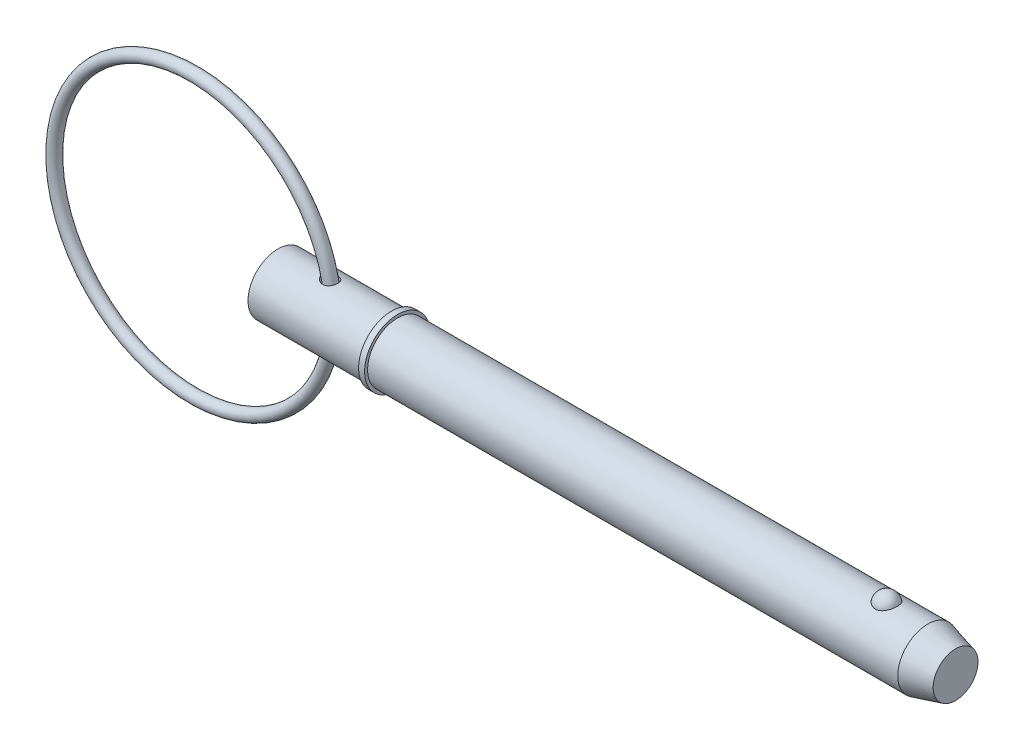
ISO-10303-21;
HEADER;
FILE_DESCRIPTION(('STEP AP214'),'2;1');
FILE_NAME('part.step','',(''),(''),'','','');
FILE_SCHEMA(('AUTOMOTIVE_DESIGN { 1 0 10303 214 1 1 1 1 }'));
ENDSEC;
DATA;
#1=APPLICATION_CONTEXT('core data for automotive mechanical design processes');
#2=APPLICATION_PROTOCOL_DEFINITION('international standard','automotive_design',2000,#1);
#3=PRODUCT_CONTEXT('',#1,'mechanical');
#4=PRODUCT('Part','Part','',(#3));
#5=PRODUCT_RELATED_PRODUCT_CATEGORY('part','',(#4));
#6=PRODUCT_DEFINITION_FORMATION('','',#4);
#7=PRODUCT_DEFINITION_CONTEXT('part definition',#1,'design');
#8=PRODUCT_DEFINITION('design','',#6,#7);
#9=PRODUCT_DEFINITION_SHAPE('','',#8);
#10=(LENGTH_UNIT() NAMED_UNIT(*) SI_UNIT(.MILLI.,.METRE.));
#11=(NAMED_UNIT(*) PLANE_ANGLE_UNIT() SI_UNIT($,.RADIAN.));
#12=(NAMED_UNIT(*) SI_UNIT($,.STERADIAN.) SOLID_ANGLE_UNIT());
#13=UNCERTAINTY_MEASURE_WITH_UNIT(LENGTH_MEASURE(1.E-05),#10,'distance_accuracy_value','');
#14=(GEOMETRIC_REPRESENTATION_CONTEXT(3) GLOBAL_UNCERTAINTY_ASSIGNED_CONTEXT((#13)) GLOBAL_UNIT_ASSIGNED_CONTEXT((#10,
#11,#12)) REPRESENTATION_CONTEXT('',''));
#15=CARTESIAN_POINT('',(0.,0.,0.));
#16=DIRECTION('',(0.,0.,1.));
#17=DIRECTION('',(1.,0.,0.));
#18=AXIS2_PLACEMENT_3D('',#15,#16,#17);
#19=CARTESIAN_POINT('',(-13.4013067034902,0.,0.));
#20=DIRECTION('',(0.,0.,1.));
#21=DIRECTION('',(1.,0.,0.));
#22=AXIS2_PLACEMENT_3D('',#19,#20,#21);
#23=TOROIDAL_SURFACE('',#22,22.225,0.952999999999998);
#24=CARTESIAN_POINT('',(9.77669329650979,0.,0.));
#25=VERTEX_POINT('',#24);
#26=VERTEX_LOOP('',#25);
#27=FACE_BOUND('',#26,.T.);
#28=ADVANCED_FACE('P0_F12',(#27),#23,.T.);
#29=CLOSED_SHELL('',(#28));
#30=MANIFOLD_SOLID_BREP('P0_B1',#29);
#31=CARTESIAN_POINT('',(0.,0.,0.));
#32=DIRECTION('',(1.,0.,0.));
#33=DIRECTION('',(0.,0.,-1.));
#34=AXIS2_PLACEMENT_3D('',#31,#32,#33);
#35=CYLINDRICAL_SURFACE('',#34,4.765);
#36=CARTESIAN_POINT('',(7.31773584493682,4.71580709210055,-0.682926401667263));
#37=CARTESIAN_POINT('',(7.3607471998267,4.70750812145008,-0.740230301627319));
#38=CARTESIAN_POINT('',(7.40883112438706,4.69869300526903,-0.79371122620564));
#39=CARTESIAN_POINT('',(7.51340999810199,4.68106981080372,-0.89180043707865));
#40=CARTESIAN_POINT('',(7.56991882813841,4.67226176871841,-0.936393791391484));
#41=CARTESIAN_POINT('',(7.689548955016,4.65568581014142,-1.01560363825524));
#42=CARTESIAN_POINT('',(7.75265928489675,4.64791621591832,-1.05023633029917));
#43=CARTESIAN_POINT('',(7.88387110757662,4.6343185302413,-1.10870278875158));
#44=CARTESIAN_POINT('',(7.95197058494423,4.62848966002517,-1.13254088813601));
#45=CARTESIAN_POINT('',(8.09209413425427,4.6194749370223,-1.16877415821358));
#46=CARTESIAN_POINT('',(8.16415141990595,4.6163169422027,-1.18104886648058));
#47=CARTESIAN_POINT('',(8.30937958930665,4.61324608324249,-1.19299123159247));
#48=CARTESIAN_POINT('',(8.38255011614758,4.61333220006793,-1.19266284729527));
#49=CARTESIAN_POINT('',(8.52374186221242,4.61674026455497,-1.17939593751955));
#50=CARTESIAN_POINT('',(8.59183022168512,4.61989017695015,-1.16712781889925));
#51=CARTESIAN_POINT('',(8.72470143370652,4.62884731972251,-1.13107903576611));
#52=CARTESIAN_POINT('',(8.78948513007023,4.63465386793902,-1.10730132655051));
#53=CARTESIAN_POINT('',(8.91088768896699,4.64792402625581,-1.05016249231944));
#54=CARTESIAN_POINT('',(8.96774302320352,4.65530108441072,-1.01728198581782));
#55=CARTESIAN_POINT('',(9.07499804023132,4.67102002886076,-0.942471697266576));
#56=CARTESIAN_POINT('',(9.12539777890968,4.6793619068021,-0.900541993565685));
#57=CARTESIAN_POINT('',(9.21836221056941,4.69607497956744,-0.808868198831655));
#58=CARTESIAN_POINT('',(9.26093651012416,4.70444612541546,-0.759133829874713));
#59=CARTESIAN_POINT('',(9.33728390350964,4.72032100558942,-0.653192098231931));
#60=CARTESIAN_POINT('',(9.3710564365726,4.72782468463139,-0.596984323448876));
#61=CARTESIAN_POINT('',(9.42940600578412,4.74126034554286,-0.478808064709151));
#62=CARTESIAN_POINT('',(9.45384681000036,4.74716869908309,-0.416769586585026));
#63=CARTESIAN_POINT('',(9.49226260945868,4.75663465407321,-0.289362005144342));
#64=CARTESIAN_POINT('',(9.50623742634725,4.76019221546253,-0.22399284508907));
#65=CARTESIAN_POINT('',(9.52342004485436,4.76458450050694,-0.0914886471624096));
#66=CARTESIAN_POINT('',(9.52658321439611,4.7654079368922,-0.0243474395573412));
#67=CARTESIAN_POINT('',(9.52194012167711,4.76421136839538,0.109528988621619));
#68=CARTESIAN_POINT('',(9.51413380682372,4.7621913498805,0.176264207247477));
#69=CARTESIAN_POINT('',(9.48775485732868,4.75552896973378,0.307367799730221));
#70=CARTESIAN_POINT('',(9.4691926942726,4.75088915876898,0.371738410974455));
#71=CARTESIAN_POINT('',(9.42175836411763,4.73949008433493,0.496364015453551));
#72=CARTESIAN_POINT('',(9.39288586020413,4.73273075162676,0.556618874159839));
#73=CARTESIAN_POINT('',(9.32549385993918,4.71782154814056,0.671371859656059));
#74=CARTESIAN_POINT('',(9.28696367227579,4.70967013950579,0.725863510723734));
#75=CARTESIAN_POINT('',(9.20123305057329,4.6928883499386,0.827453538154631));
#76=CARTESIAN_POINT('',(9.15403300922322,4.68425799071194,0.874552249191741));
#77=CARTESIAN_POINT('',(9.05250467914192,4.66754854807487,0.959736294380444));
#78=CARTESIAN_POINT('',(8.99822095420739,4.65946646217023,0.997874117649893));
#79=CARTESIAN_POINT('',(8.88381123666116,4.64472049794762,1.06440739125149));
#80=CARTESIAN_POINT('',(8.82368614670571,4.63805640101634,1.09280434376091));
#81=CARTESIAN_POINT('',(8.70022952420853,4.62698068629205,1.13878427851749));
#82=CARTESIAN_POINT('',(8.63695594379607,4.62253830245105,1.15651569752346));
#83=CARTESIAN_POINT('',(8.50825296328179,4.61622454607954,1.18146656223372));
#84=CARTESIAN_POINT('',(8.44282353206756,4.61435321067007,1.18868585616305));
#85=CARTESIAN_POINT('',(8.31119087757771,4.61332122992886,1.19268442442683));
#86=CARTESIAN_POINT('',(8.24498542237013,4.61417920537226,1.18939198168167));
#87=CARTESIAN_POINT('',(8.11397487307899,4.61847671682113,1.17259121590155));
#88=CARTESIAN_POINT('',(8.04917011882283,4.62191687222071,1.15908044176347));
#89=CARTESIAN_POINT('',(7.91946226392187,4.63117528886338,1.12153047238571));
#90=CARTESIAN_POINT('',(7.85470460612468,4.6371000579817,1.09701575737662));
#91=CARTESIAN_POINT('',(7.7300035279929,4.65063246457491,1.03814807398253));
#92=CARTESIAN_POINT('',(7.67006197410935,4.65824075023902,1.00379131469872));
#93=CARTESIAN_POINT('',(7.55352765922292,4.67473656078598,0.924015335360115));
#94=CARTESIAN_POINT('',(7.49726947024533,4.68366994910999,0.878115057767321));
#95=CARTESIAN_POINT('',(7.39344083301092,4.70144936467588,0.777311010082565));
#96=CARTESIAN_POINT('',(7.34587087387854,4.71029538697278,0.722406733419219));
#97=CARTESIAN_POINT('',(7.26188955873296,4.72669773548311,0.605773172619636));
#98=CARTESIAN_POINT('',(7.22531316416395,4.73427229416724,0.544165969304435));
#99=CARTESIAN_POINT('',(7.16406269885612,4.74732663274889,0.415095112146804));
#100=CARTESIAN_POINT('',(7.13937848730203,4.75280819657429,0.347636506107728));
#101=CARTESIAN_POINT('',(7.10494917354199,4.7605495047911,0.215359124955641));
#102=CARTESIAN_POINT('',(7.09405441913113,4.76305589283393,0.150853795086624));
#103=CARTESIAN_POINT('',(7.08387189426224,4.76539656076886,0.0208839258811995));
#104=CARTESIAN_POINT('',(7.0845805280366,4.76523166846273,-0.0445803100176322));
#105=CARTESIAN_POINT('',(7.09709111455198,4.76236014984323,-0.169693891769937));
#106=CARTESIAN_POINT('',(7.10810913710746,4.75983315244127,-0.229428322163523));
#107=CARTESIAN_POINT('',(7.13959099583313,4.75276726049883,-0.346187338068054));
#108=CARTESIAN_POINT('',(7.16004881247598,4.7482296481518,-0.403213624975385));
#109=CARTESIAN_POINT('',(7.20270325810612,4.73907067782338,-0.498040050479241));
#110=CARTESIAN_POINT('',(7.22286864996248,4.73481668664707,-0.536809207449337));
#111=CARTESIAN_POINT('',(7.26730952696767,4.72570777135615,-0.611832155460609));
#112=CARTESIAN_POINT('',(7.29158512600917,4.72085283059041,-0.64808587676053));
#113=CARTESIAN_POINT('',(7.31773584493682,4.71580709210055,-0.682926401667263));
#114=B_SPLINE_CURVE_WITH_KNOTS('',3,(#36,#37,#38,#39,#40,#41,#42,#43,#44,#45,#46,#47,#48,#49,
#50,#51,#52,#53,#54,#55,#56,#57,#58,#59,#60,#61,#62,#63,#64,#65,#66,#67,#68,#69,#70,#71,#72,#73,
#74,#75,#76,#77,#78,#79,#80,#81,#82,#83,#84,#85,#86,#87,#88,#89,#90,#91,#92,#93,#94,#95,#96,#97,
#98,#99,#100,#101,#102,#103,#104,#105,#106,#107,#108,#109,#110,#111,#112,#113),.UNSPECIFIED.,
.T.,.F.,(4,2,2,2,2,2,2,2,2,2,2,2,2,2,2,2,2,2,2,2,2,2,2,2,2,2,2,2,2,2,2,2,2,2,2,2,2,2,4),(0.,
0.216219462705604,0.432799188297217,0.649024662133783,0.865163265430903,1.08352938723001,
1.30182691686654,1.50853487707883,1.71518978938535,1.91252381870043,2.1098561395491,
2.30694457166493,2.50404555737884,2.70392296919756,2.90380378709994,3.10450875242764,
3.30521468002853,3.5057255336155,3.70624293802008,3.90698330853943,4.10771458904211,
4.30723900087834,4.50673262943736,4.70338139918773,4.90003300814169,5.09802914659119,
5.29607279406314,5.5036500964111,5.7113074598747,5.92972727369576,6.14815938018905,
6.36312650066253,6.57790998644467,6.77325899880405,6.96854747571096,7.15009726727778,
7.33153144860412,7.46298830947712,7.59444881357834),.UNSPECIFIED.);
#115=CARTESIAN_POINT('',(7.31773584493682,4.71580709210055,-0.682926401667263));
#116=VERTEX_POINT('',#115);
#117=EDGE_CURVE('P1_E42',#116,#116,#114,.T.);
#118=ORIENTED_EDGE('',*,*,#117,.T.);
#119=EDGE_LOOP('',(#118));
#120=FACE_BOUND('',#119,.T.);
#121=CARTESIAN_POINT('',(0.,0.,0.));
#122=DIRECTION('',(1.,0.,0.));
#123=DIRECTION('',(0.,0.,-1.));
#124=AXIS2_PLACEMENT_3D('',#121,#122,#123);
#125=CIRCLE('',#124,4.765);
#126=CARTESIAN_POINT('',(0.,0.,-4.765));
#127=VERTEX_POINT('',#126);
#128=EDGE_CURVE('P1_E9',#127,#127,#125,.T.);
#129=ORIENTED_EDGE('',*,*,#128,.T.);
#130=EDGE_LOOP('',(#129));
#131=FACE_BOUND('',#130,.T.);
#132=CARTESIAN_POINT('',(18.097,0.,0.));
#133=DIRECTION('',(1.,0.,0.));
#134=DIRECTION('',(0.,0.,-1.));
#135=AXIS2_PLACEMENT_3D('',#132,#133,#134);
#136=CIRCLE('',#135,4.765);
#137=CARTESIAN_POINT('',(18.097,0.,-4.765));
#138=VERTEX_POINT('',#137);
#139=EDGE_CURVE('P1_E25',#138,#138,#136,.T.);
#140=ORIENTED_EDGE('',*,*,#139,.F.);
#141=EDGE_LOOP('',(#140));
#142=FACE_BOUND('',#141,.T.);
#143=CARTESIAN_POINT('',(7.31773584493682,-4.71580709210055,-0.682926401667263));
#144=CARTESIAN_POINT('',(7.27956054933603,-4.72317282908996,-0.63206220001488));
#145=CARTESIAN_POINT('',(7.24535712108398,-4.7301361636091,-0.578155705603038));
#146=CARTESIAN_POINT('',(7.18611785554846,-4.74256090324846,-0.465352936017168));
#147=CARTESIAN_POINT('',(7.16107836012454,-4.74802290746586,-0.406458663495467));
#148=CARTESIAN_POINT('',(7.12119149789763,-4.75686558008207,-0.284913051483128));
#149=CARTESIAN_POINT('',(7.1063796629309,-4.76023898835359,-0.222249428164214));
#150=CARTESIAN_POINT('',(7.08786546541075,-4.76447177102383,-0.0952170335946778));
#151=CARTESIAN_POINT('',(7.08416018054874,-4.76533180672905,-0.0308487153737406));
#152=CARTESIAN_POINT('',(7.08795686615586,-4.76445764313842,0.0942755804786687));
#153=CARTESIAN_POINT('',(7.09490366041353,-4.762851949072,0.155050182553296));
#154=CARTESIAN_POINT('',(7.11863973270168,-4.75746086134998,0.2745356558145));
#155=CARTESIAN_POINT('',(7.13542953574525,-4.75367535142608,0.333246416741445));
#156=CARTESIAN_POINT('',(7.17817193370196,-4.74430545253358,0.447305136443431));
#157=CARTESIAN_POINT('',(7.20415836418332,-4.73871442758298,0.502639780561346));
#158=CARTESIAN_POINT('',(7.26428068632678,-4.72628508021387,0.608523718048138));
#159=CARTESIAN_POINT('',(7.29841897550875,-4.71944639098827,0.659071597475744));
#160=CARTESIAN_POINT('',(7.37680984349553,-4.70456239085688,0.758311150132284));
#161=CARTESIAN_POINT('',(7.42165519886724,-4.69646426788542,0.806526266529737));
#162=CARTESIAN_POINT('',(7.51828933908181,-4.68032890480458,0.895428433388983));
#163=CARTESIAN_POINT('',(7.57008134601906,-4.67229169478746,0.936111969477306));
#164=CARTESIAN_POINT('',(7.68397204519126,-4.65640659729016,1.01229731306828));
#165=CARTESIAN_POINT('',(7.74657226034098,-4.64863251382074,1.04706751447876));
#166=CARTESIAN_POINT('',(7.87680110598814,-4.6349740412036,1.10596507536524));
#167=CARTESIAN_POINT('',(7.94443054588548,-4.62908995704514,1.13009071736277));
#168=CARTESIAN_POINT('',(8.08402017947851,-4.61989019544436,1.16713943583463));
#169=CARTESIAN_POINT('',(8.15603143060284,-4.61661596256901,1.17988211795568));
#170=CARTESIAN_POINT('',(8.30124697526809,-4.61330446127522,1.1927680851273));
#171=CARTESIAN_POINT('',(8.37445077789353,-4.61326589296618,1.19291642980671));
#172=CARTESIAN_POINT('',(8.51584800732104,-4.61644036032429,1.18056687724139));
#173=CARTESIAN_POINT('',(8.58410302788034,-4.61948317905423,1.16873099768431));
#174=CARTESIAN_POINT('',(8.71738052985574,-4.6282520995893,1.13350536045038));
#175=CARTESIAN_POINT('',(8.78240382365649,-4.63397752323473,1.11011852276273));
#176=CARTESIAN_POINT('',(8.90428519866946,-4.64711877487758,1.05371003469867));
#177=CARTESIAN_POINT('',(8.96138096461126,-4.6544450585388,1.02117932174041));
#178=CARTESIAN_POINT('',(9.06916653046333,-4.6700970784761,0.947021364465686));
#179=CARTESIAN_POINT('',(9.11985639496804,-4.67842280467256,0.905394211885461));
#180=CARTESIAN_POINT('',(9.2134071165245,-4.69513303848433,0.814300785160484));
#181=CARTESIAN_POINT('',(9.25628268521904,-4.70351740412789,0.764849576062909));
#182=CARTESIAN_POINT('',(9.33327173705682,-4.71945185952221,0.659422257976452));
#183=CARTESIAN_POINT('',(9.3673846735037,-4.72700189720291,0.603445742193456));
#184=CARTESIAN_POINT('',(9.42645214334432,-4.74055953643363,0.485673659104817));
#185=CARTESIAN_POINT('',(9.45127042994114,-4.74654383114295,0.423807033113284));
#186=CARTESIAN_POINT('',(9.49046298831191,-4.756182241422,0.296676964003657));
#187=CARTESIAN_POINT('',(9.50483706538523,-4.75983631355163,0.231413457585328));
#188=CARTESIAN_POINT('',(9.52283408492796,-4.76443282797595,0.0990368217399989));
#189=CARTESIAN_POINT('',(9.52641016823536,-4.76536345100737,0.0319169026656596));
#190=CARTESIAN_POINT('',(9.52259067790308,-4.76437893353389,-0.101988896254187));
#191=CARTESIAN_POINT('',(9.5151950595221,-4.76246378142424,-0.168774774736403));
#192=CARTESIAN_POINT('',(9.48962516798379,-4.75599746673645,-0.300048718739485));
#193=CARTESIAN_POINT('',(9.4714615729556,-4.75144891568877,-0.364538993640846));
#194=CARTESIAN_POINT('',(9.42480303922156,-4.74020887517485,-0.489470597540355));
#195=CARTESIAN_POINT('',(9.396307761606,-4.73351731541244,-0.549911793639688));
#196=CARTESIAN_POINT('',(9.32963953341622,-4.71871240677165,-0.665099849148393));
#197=CARTESIAN_POINT('',(9.29145577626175,-4.71059747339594,-0.719840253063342));
#198=CARTESIAN_POINT('',(9.20637695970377,-4.69385254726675,-0.82198328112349));
#199=CARTESIAN_POINT('',(9.15948227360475,-4.68522257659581,-0.869386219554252));
#200=CARTESIAN_POINT('',(9.05849937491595,-4.66847516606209,-0.955233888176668));
#201=CARTESIAN_POINT('',(9.00445430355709,-4.6603550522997,-0.993728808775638));
#202=CARTESIAN_POINT('',(8.8904576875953,-4.64550122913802,-1.06100691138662));
#203=CARTESIAN_POINT('',(8.83050704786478,-4.63876730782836,-1.08979157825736));
#204=CARTESIAN_POINT('',(8.70732873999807,-4.6275305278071,-1.13655620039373));
#205=CARTESIAN_POINT('',(8.64416019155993,-4.62299714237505,-1.15468477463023));
#206=CARTESIAN_POINT('',(8.51559711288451,-4.61649071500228,-1.18043067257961));
#207=CARTESIAN_POINT('',(8.4502025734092,-4.61451768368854,-1.18804795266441));
#208=CARTESIAN_POINT('',(8.31862013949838,-4.61328355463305,-1.19283094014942));
#209=CARTESIAN_POINT('',(8.25242983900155,-4.61403911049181,-1.18993246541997));
#210=CARTESIAN_POINT('',(8.12138461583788,-4.61814057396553,-1.17391149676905));
#211=CARTESIAN_POINT('',(8.0565300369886,-4.62148714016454,-1.16078640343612));
#212=CARTESIAN_POINT('',(7.92669960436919,-4.63056912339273,-1.12402333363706));
#213=CARTESIAN_POINT('',(7.86186447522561,-4.63641051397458,-1.09991536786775));
#214=CARTESIAN_POINT('',(7.73694230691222,-4.64980121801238,-1.04185298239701));
#215=CARTESIAN_POINT('',(7.6768568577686,-4.65735110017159,-1.0078952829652));
#216=CARTESIAN_POINT('',(7.56207884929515,-4.67346080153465,-0.930364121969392));
#217=CARTESIAN_POINT('',(7.5074784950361,-4.68203382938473,-0.886656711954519));
#218=CARTESIAN_POINT('',(7.40624045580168,-4.69916824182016,-0.79082583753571));
#219=CARTESIAN_POINT('',(7.35959988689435,-4.7077296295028,-0.738705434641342));
#220=CARTESIAN_POINT('',(7.31773584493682,-4.71580709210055,-0.682926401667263));
#221=B_SPLINE_CURVE_WITH_KNOTS('',3,(#143,#144,#145,#146,#147,#148,#149,#150,#151,#152,#153,
#154,#155,#156,#157,#158,#159,#160,#161,#162,#163,#164,#165,#166,#167,#168,#169,#170,#171,#172,
#173,#174,#175,#176,#177,#178,#179,#180,#181,#182,#183,#184,#185,#186,#187,#188,#189,#190,#191,
#192,#193,#194,#195,#196,#197,#198,#199,#200,#201,#202,#203,#204,#205,#206,#207,#208,#209,#210,
#211,#212,#213,#214,#215,#216,#217,#218,#219,#220),.UNSPECIFIED.,.T.,.F.,(4,2,2,2,2,2,2,2,2,2,2,
2,2,2,2,2,2,2,2,2,2,2,2,2,2,2,2,2,2,2,2,2,2,2,2,2,2,2,4),(0.,0.191851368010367,0.38362606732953,
0.576063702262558,0.768450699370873,0.951145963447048,1.13385097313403,1.31723528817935,
1.50067360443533,1.69887079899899,1.8971602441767,2.11225870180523,2.32739185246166,
2.54587681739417,2.76427400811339,2.97123130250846,3.17813630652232,3.37555441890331,
3.57297054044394,3.77001106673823,3.96706388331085,4.16690159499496,4.36674303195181,
4.56745046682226,4.76815872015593,4.96866827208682,5.16918440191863,5.36992517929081,
5.5706573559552,5.77022940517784,5.96977092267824,6.16645904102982,6.36314797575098,
6.56103940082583,6.75898114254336,6.96633026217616,7.17374850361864,7.384214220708,
7.59460352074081),.UNSPECIFIED.);
#222=CARTESIAN_POINT('',(7.31773584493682,-4.71580709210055,-0.682926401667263));
#223=VERTEX_POINT('',#222);
#224=EDGE_CURVE('P1_E17',#223,#223,#221,.T.);
#225=ORIENTED_EDGE('',*,*,#224,.T.);
#226=EDGE_LOOP('',(#225));
#227=FACE_BOUND('',#226,.T.);
#228=ADVANCED_FACE('P1_F13',(#120,#131,#142,#227),#35,.T.);
#229=CARTESIAN_POINT('',(0.,0.,0.));
#230=DIRECTION('',(1.,0.,0.));
#231=DIRECTION('',(0.,0.,-1.));
#232=AXIS2_PLACEMENT_3D('',#229,#230,#231);
#233=CYLINDRICAL_SURFACE('',#232,4.765);
#234=CARTESIAN_POINT('',(103.504194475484,0.,0.));
#235=DIRECTION('',(1.,0.,0.));
#236=DIRECTION('',(0.,0.,-1.));
#237=AXIS2_PLACEMENT_3D('',#234,#235,#236);
#238=CIRCLE('',#237,4.765);
#239=CARTESIAN_POINT('',(103.504194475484,0.,-4.765));
#240=VERTEX_POINT('',#239);
#241=EDGE_CURVE('P1_E99',#240,#240,#238,.T.);
#242=ORIENTED_EDGE('',*,*,#241,.F.);
#243=EDGE_LOOP('',(#242));
#244=FACE_BOUND('',#243,.T.);
#245=CARTESIAN_POINT('',(19.05,0.,0.));
#246=DIRECTION('',(1.,0.,0.));
#247=DIRECTION('',(0.,0.,-1.));
#248=AXIS2_PLACEMENT_3D('',#245,#246,#247);
#249=CIRCLE('',#248,4.765);
#250=CARTESIAN_POINT('',(19.05,0.,-4.765));
#251=VERTEX_POINT('',#250);
#252=EDGE_CURVE('P1_E96',#251,#251,#249,.T.);
#253=ORIENTED_EDGE('',*,*,#252,.T.);
#254=EDGE_LOOP('',(#253));
#255=FACE_BOUND('',#254,.T.);
#256=CARTESIAN_POINT('',(96.951020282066,4.42764777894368,1.76101111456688));
#257=CARTESIAN_POINT('',(96.8597212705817,4.42764470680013,1.76101422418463));
#258=CARTESIAN_POINT('',(96.7684468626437,4.43059091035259,1.75366340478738));
#259=CARTESIAN_POINT('',(96.5886154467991,4.44201846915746,1.72451180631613));
#260=CARTESIAN_POINT('',(96.5000577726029,4.45049845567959,1.70271460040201));
#261=CARTESIAN_POINT('',(96.3282570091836,4.47200516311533,1.6453937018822));
#262=CARTESIAN_POINT('',(96.2450064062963,4.48502527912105,1.60988994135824));
#263=CARTESIAN_POINT('',(96.0857633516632,4.51419542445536,1.52617873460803));
#264=CARTESIAN_POINT('',(96.0097723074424,4.53034605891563,1.47796883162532));
#265=CARTESIAN_POINT('',(95.8647445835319,4.5645931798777,1.36860494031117));
#266=CARTESIAN_POINT('',(95.7959645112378,4.58273170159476,1.3071242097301));
#267=CARTESIAN_POINT('',(95.6693423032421,4.61870302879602,1.17370204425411));
#268=CARTESIAN_POINT('',(95.6115021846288,4.63653577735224,1.10175868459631));
#269=CARTESIAN_POINT('',(95.5055709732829,4.67090140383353,0.945806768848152));
#270=CARTESIAN_POINT('',(95.4580305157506,4.68734068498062,0.861402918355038));
#271=CARTESIAN_POINT('',(95.3770817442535,4.71628466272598,0.685442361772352));
#272=CARTESIAN_POINT('',(95.3436747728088,4.72878898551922,0.59388497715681));
#273=CARTESIAN_POINT('',(95.291287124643,4.74874061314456,0.404781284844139));
#274=CARTESIAN_POINT('',(95.2725178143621,4.75611366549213,0.30716844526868));
#275=CARTESIAN_POINT('',(95.2505846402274,4.76475393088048,0.109940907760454));
#276=CARTESIAN_POINT('',(95.2474205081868,4.76602124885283,0.0103262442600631));
#277=CARTESIAN_POINT('',(95.2567405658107,4.76232928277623,-0.187629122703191));
#278=CARTESIAN_POINT('',(95.2691588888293,4.7573962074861,-0.285973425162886));
#279=CARTESIAN_POINT('',(95.3092804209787,4.74184975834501,-0.47902728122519));
#280=CARTESIAN_POINT('',(95.3369839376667,4.7312362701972,-0.573736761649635));
#281=CARTESIAN_POINT('',(95.4071581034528,4.70540026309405,-0.756973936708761));
#282=CARTESIAN_POINT('',(95.4496460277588,4.69017235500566,-0.845494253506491));
#283=CARTESIAN_POINT('',(95.548520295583,4.6566986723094,-1.01378033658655));
#284=CARTESIAN_POINT('',(95.6049076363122,4.63845268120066,-1.09354547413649));
#285=CARTESIAN_POINT('',(95.730552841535,4.60085438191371,-1.24228523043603));
#286=CARTESIAN_POINT('',(95.7998439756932,4.58149930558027,-1.31123108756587));
#287=CARTESIAN_POINT('',(95.9496066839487,4.54391653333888,-1.43607409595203));
#288=CARTESIAN_POINT('',(96.0300771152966,4.52568872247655,-1.49197257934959));
#289=CARTESIAN_POINT('',(96.1981500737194,4.49293007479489,-1.58786764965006));
#290=CARTESIAN_POINT('',(96.2855445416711,4.47832346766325,-1.62820219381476));
#291=CARTESIAN_POINT('',(96.466553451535,4.45406011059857,-1.69345757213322));
#292=CARTESIAN_POINT('',(96.5601655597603,4.44440151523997,-1.71838415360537));
#293=CARTESIAN_POINT('',(96.7458939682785,4.43159888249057,-1.75112843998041));
#294=CARTESIAN_POINT('',(96.837849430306,4.42815213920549,-1.75974223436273));
#295=CARTESIAN_POINT('',(97.0219658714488,4.427247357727,-1.76201865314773));
#296=CARTESIAN_POINT('',(97.1141268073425,4.42978816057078,-1.7556841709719));
#297=CARTESIAN_POINT('',(97.2931292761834,4.4403864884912,-1.72869560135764));
#298=CARTESIAN_POINT('',(97.3800474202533,4.44827555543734,-1.70847853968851));
#299=CARTESIAN_POINT('',(97.5491314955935,4.46852246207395,-1.65479562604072));
#300=CARTESIAN_POINT('',(97.6312970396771,4.48088066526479,-1.62132869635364));
#301=CARTESIAN_POINT('',(97.7905916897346,4.50907357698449,-1.54120560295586));
#302=CARTESIAN_POINT('',(97.8675700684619,4.52497884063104,-1.49427526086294));
#303=CARTESIAN_POINT('',(98.0127080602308,4.55845148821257,-1.38881222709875));
#304=CARTESIAN_POINT('',(98.0808656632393,4.57601924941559,-1.33027689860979));
#305=CARTESIAN_POINT('',(98.2100990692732,4.61196537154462,-1.19991049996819));
#306=CARTESIAN_POINT('',(98.2706562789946,4.63034074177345,-1.12756415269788));
#307=CARTESIAN_POINT('',(98.3792797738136,4.66513959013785,-0.973612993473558));
#308=CARTESIAN_POINT('',(98.4273438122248,4.68156271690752,-0.892006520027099));
#309=CARTESIAN_POINT('',(98.511383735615,4.71130224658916,-0.71889227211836));
#310=CARTESIAN_POINT('',(98.5469185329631,4.724501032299,-0.627149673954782));
#311=CARTESIAN_POINT('',(98.6029522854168,4.74571823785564,-0.438611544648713));
#312=CARTESIAN_POINT('',(98.623450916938,4.75373654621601,-0.341815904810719));
#313=CARTESIAN_POINT('',(98.6490338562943,4.76378905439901,-0.145633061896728));
#314=CARTESIAN_POINT('',(98.654076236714,4.76580697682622,-0.04623954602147));
#315=CARTESIAN_POINT('',(98.6485239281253,4.7636057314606,0.152038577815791));
#316=CARTESIAN_POINT('',(98.6379294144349,4.75938663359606,0.250923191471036));
#317=CARTESIAN_POINT('',(98.6013875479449,4.74516937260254,0.445004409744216));
#318=CARTESIAN_POINT('',(98.5754964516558,4.73519238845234,0.540213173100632));
#319=CARTESIAN_POINT('',(98.5089273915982,4.7104939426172,0.724662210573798));
#320=CARTESIAN_POINT('',(98.468248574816,4.69577220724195,0.813902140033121));
#321=CARTESIAN_POINT('',(98.3727177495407,4.66303767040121,0.984313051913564));
#322=CARTESIAN_POINT('',(98.3178042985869,4.64501070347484,1.06544688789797));
#323=CARTESIAN_POINT('',(98.1950496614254,4.60764678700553,1.21692673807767));
#324=CARTESIAN_POINT('',(98.1272086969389,4.58830985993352,1.2872729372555));
#325=CARTESIAN_POINT('',(97.9805480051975,4.55060370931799,1.41479271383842));
#326=CARTESIAN_POINT('',(97.9017918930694,4.53222967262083,1.47203785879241));
#327=CARTESIAN_POINT('',(97.7349890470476,4.49849576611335,1.57212016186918));
#328=CARTESIAN_POINT('',(97.6469417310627,4.48313608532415,1.61495641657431));
#329=CARTESIAN_POINT('',(97.4597918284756,4.45676184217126,1.68642657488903));
#330=CARTESIAN_POINT('',(97.3603653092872,4.44598302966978,1.71430590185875));
#331=CARTESIAN_POINT('',(97.1576210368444,4.43142918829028,1.75159258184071));
#332=CARTESIAN_POINT('',(97.0543049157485,4.42765125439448,1.76100759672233));
#333=CARTESIAN_POINT('',(96.951020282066,4.42764777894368,1.76101111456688));
#334=B_SPLINE_CURVE_WITH_KNOTS('',3,(#256,#257,#258,#259,#260,#261,#262,#263,#264,#265,#266,
#267,#268,#269,#270,#271,#272,#273,#274,#275,#276,#277,#278,#279,#280,#281,#282,#283,#284,#285,
#286,#287,#288,#289,#290,#291,#292,#293,#294,#295,#296,#297,#298,#299,#300,#301,#302,#303,#304,
#305,#306,#307,#308,#309,#310,#311,#312,#313,#314,#315,#316,#317,#318,#319,#320,#321,#322,#323,
#324,#325,#326,#327,#328,#329,#330,#331,#332,#333),.UNSPECIFIED.,.T.,.F.,(4,2,2,2,2,2,2,2,2,2,2,
2,2,2,2,2,2,2,2,2,2,2,2,2,2,2,2,2,2,2,2,2,2,2,2,2,2,2,4),(0.,0.273517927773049,
0.546968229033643,0.820022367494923,1.09312934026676,1.37393946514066,1.65480131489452,
1.94820420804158,2.24163496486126,2.53922817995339,2.8368162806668,3.13315071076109,
3.42949110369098,3.72617893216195,4.02288805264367,4.32037303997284,4.61782764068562,
4.9084009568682,5.19886582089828,5.4747485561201,5.75057789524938,6.01809977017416,
6.2856434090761,6.55907787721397,6.83257454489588,7.11962987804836,7.40673679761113,
7.70312663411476,7.99952284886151,8.29672237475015,8.59391856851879,8.89002850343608,
9.18615552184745,9.483582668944,9.78100471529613,10.0767610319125,10.3725358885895,
10.6820893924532,10.991514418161),.UNSPECIFIED.);
#335=CARTESIAN_POINT('',(96.951020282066,4.42764777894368,1.76101111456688));
#336=VERTEX_POINT('',#335);
#337=EDGE_CURVE('P1_E34',#336,#336,#334,.T.);
#338=ORIENTED_EDGE('',*,*,#337,.T.);
#339=EDGE_LOOP('',(#338));
#340=FACE_BOUND('',#339,.T.);
#341=ADVANCED_FACE('P1_F46',(#244,#255,#340),#233,.T.);
#342=CARTESIAN_POINT('',(0.,0.,0.));
#343=DIRECTION('',(-1.,0.,0.));
#344=DIRECTION('',(0.,0.,1.));
#345=AXIS2_PLACEMENT_3D('',#342,#343,#344);
#346=PLANE('',#345);
#347=ORIENTED_EDGE('',*,*,#128,.F.);
#348=EDGE_LOOP('',(#347));
#349=FACE_BOUND('',#348,.T.);
#350=ADVANCED_FACE('P1_F15',(#349),#346,.T.);
#351=CARTESIAN_POINT('',(18.097,4.765,0.));
#352=DIRECTION('',(-1.,0.,0.));
#353=DIRECTION('',(0.,0.,1.));
#354=AXIS2_PLACEMENT_3D('',#351,#352,#353);
#355=PLANE('',#354);
#356=ORIENTED_EDGE('',*,*,#139,.T.);
#357=EDGE_LOOP('',(#356));
#358=FACE_BOUND('',#357,.T.);
#359=CARTESIAN_POINT('',(18.097,0.,0.));
#360=DIRECTION('',(1.,0.,0.));
#361=DIRECTION('',(0.,0.,-1.));
#362=AXIS2_PLACEMENT_3D('',#359,#360,#361);
#363=CIRCLE('',#362,5.2415);
#364=CARTESIAN_POINT('',(18.097,0.,-5.2415));
#365=VERTEX_POINT('',#364);
#366=EDGE_CURVE('P1_E30',#365,#365,#363,.T.);
#367=ORIENTED_EDGE('',*,*,#366,.F.);
#368=EDGE_LOOP('',(#367));
#369=FACE_BOUND('',#368,.T.);
#370=ADVANCED_FACE('P1_F81',(#358,#369),#355,.T.);
#371=CARTESIAN_POINT('',(0.,0.,0.));
#372=DIRECTION('',(1.,0.,0.));
#373=DIRECTION('',(0.,0.,-1.));
#374=AXIS2_PLACEMENT_3D('',#371,#372,#373);
#375=CYLINDRICAL_SURFACE('',#374,5.2415);
#376=ORIENTED_EDGE('',*,*,#366,.T.);
#377=EDGE_LOOP('',(#376));
#378=FACE_BOUND('',#377,.T.);
#379=CARTESIAN_POINT('',(19.05,0.,0.));
#380=DIRECTION('',(1.,0.,0.));
#381=DIRECTION('',(0.,0.,-1.));
#382=AXIS2_PLACEMENT_3D('',#379,#380,#381);
#383=CIRCLE('',#382,5.2415);
#384=CARTESIAN_POINT('',(19.05,0.,-5.2415));
#385=VERTEX_POINT('',#384);
#386=EDGE_CURVE('P1_E95',#385,#385,#383,.T.);
#387=ORIENTED_EDGE('',*,*,#386,.F.);
#388=EDGE_LOOP('',(#387));
#389=FACE_BOUND('',#388,.T.);
#390=ADVANCED_FACE('P1_F68',(#378,#389),#375,.T.);
#391=CARTESIAN_POINT('',(19.05,5.2415,0.));
#392=DIRECTION('',(1.,0.,0.));
#393=DIRECTION('',(0.,0.,-1.));
#394=AXIS2_PLACEMENT_3D('',#391,#392,#393);
#395=PLANE('',#394);
#396=ORIENTED_EDGE('',*,*,#386,.T.);
#397=EDGE_LOOP('',(#396));
#398=FACE_BOUND('',#397,.T.);
#399=ORIENTED_EDGE('',*,*,#252,.F.);
#400=EDGE_LOOP('',(#399));
#401=FACE_BOUND('',#400,.T.);
#402=ADVANCED_FACE('P1_F62',(#398,#401),#395,.T.);
#403=CARTESIAN_POINT('',(107.95,0.,0.));
#404=DIRECTION('',(-1.,0.,0.));
#405=DIRECTION('',(0.,0.,1.));
#406=AXIS2_PLACEMENT_3D('',#403,#404,#405);
#407=CONICAL_SURFACE('',#406,3.57375000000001,0.26179938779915);
#408=ORIENTED_EDGE('',*,*,#241,.T.);
#409=EDGE_LOOP('',(#408));
#410=FACE_BOUND('',#409,.T.);
#411=CARTESIAN_POINT('',(107.95,0.,0.));
#412=DIRECTION('',(1.,0.,0.));
#413=DIRECTION('',(0.,0.,-1.));
#414=AXIS2_PLACEMENT_3D('',#411,#412,#413);
#415=CIRCLE('',#414,3.57375000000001);
#416=CARTESIAN_POINT('',(107.95,0.,-3.57375000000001));
#417=VERTEX_POINT('',#416);
#418=EDGE_CURVE('P1_E41',#417,#417,#415,.T.);
#419=ORIENTED_EDGE('',*,*,#418,.F.);
#420=EDGE_LOOP('',(#419));
#421=FACE_BOUND('',#420,.T.);
#422=ADVANCED_FACE('P1_F59',(#410,#421),#407,.T.);
#423=CARTESIAN_POINT('',(107.95,3.57375000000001,0.));
#424=DIRECTION('',(1.,0.,0.));
#425=DIRECTION('',(0.,0.,-1.));
#426=AXIS2_PLACEMENT_3D('',#423,#424,#425);
#427=PLANE('',#426);
#428=ORIENTED_EDGE('',*,*,#418,.T.);
#429=EDGE_LOOP('',(#428));
#430=FACE_BOUND('',#429,.T.);
#431=ADVANCED_FACE('P1_F55',(#430),#427,.T.);
#432=CARTESIAN_POINT('',(96.951020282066,4.2885,0.));
#433=DIRECTION('',(-1.,0.,0.));
#434=DIRECTION('',(0.,-1.,0.));
#435=AXIS2_PLACEMENT_3D('',#432,#433,#434);
#436=SPHERICAL_SURFACE('',#435,1.7665);
#437=ORIENTED_EDGE('',*,*,#337,.F.);
#438=EDGE_LOOP('',(#437));
#439=FACE_BOUND('',#438,.T.);
#440=ADVANCED_FACE('P1_F50',(#439),#436,.T.);
#441=CARTESIAN_POINT('',(-13.4013067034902,0.,0.));
#442=DIRECTION('',(0.,0.,1.));
#443=DIRECTION('',(1.,0.,0.));
#444=AXIS2_PLACEMENT_3D('',#441,#442,#443);
#445=TOROIDAL_SURFACE('',#444,22.225,1.19125);
#446=ORIENTED_EDGE('',*,*,#224,.F.);
#447=EDGE_LOOP('',(#446));
#448=FACE_BOUND('',#447,.T.);
#449=ORIENTED_EDGE('',*,*,#117,.F.);
#450=EDGE_LOOP('',(#449));
#451=FACE_BOUND('',#450,.T.);
#452=ADVANCED_FACE('P1_F54',(#448,#451),#445,.F.);
#453=CLOSED_SHELL('',(#228,#341,#350,#370,#390,#402,#422,#431,#440,#452));
#454=MANIFOLD_SOLID_BREP('P1_B1',#453);
#455=ADVANCED_BREP_SHAPE_REPRESENTATION('',(#18,#30,#454),#14);
#456=SHAPE_DEFINITION_REPRESENTATION(#9,#455);
ENDSEC;
END-ISO-10303-21;
